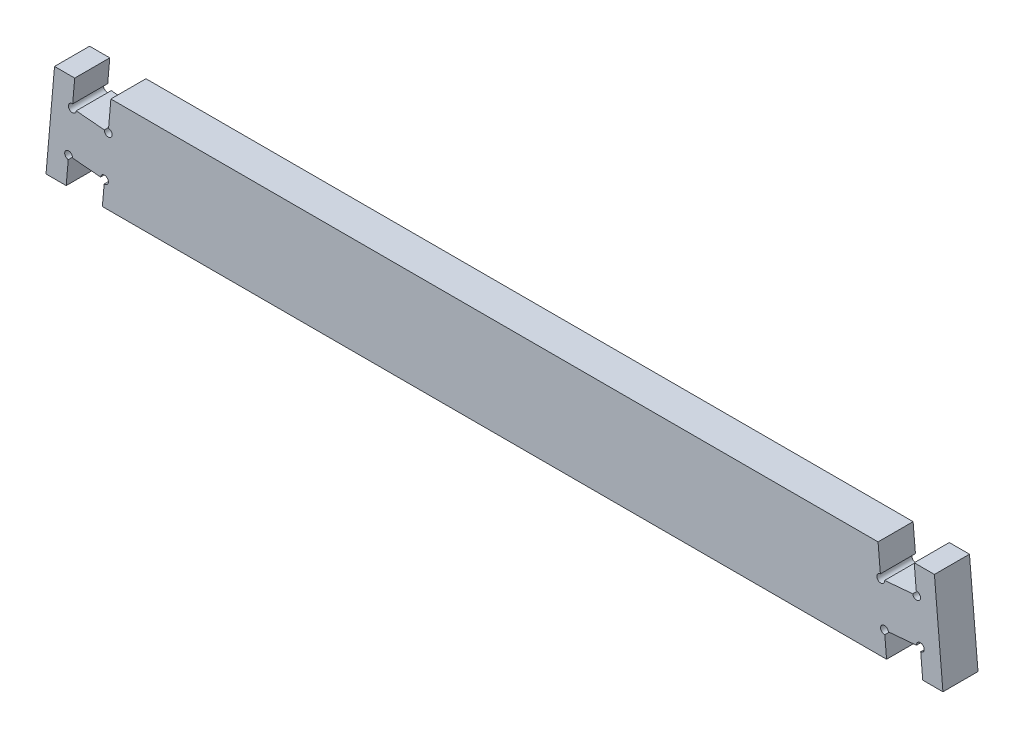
from build123d import *

# Parameters (mm, degrees)
BOSS_EXTRUDE1_DEPTH = 18
CUT_EXTRUDE1_REACH  = 413.236
SKETCH2_R           = 2


with BuildPart() as part:
    # Sketch1 → Boss-Extrude1 (new body)
    with BuildSketch(Plane.XY):
        Polygon((199.401555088, -312.400652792), (180.971953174, -314.013034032), (182.06305364, -326.484369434), (-220.466570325, -326.484369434), (-219.375469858, -314.013034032), (-237.805071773, -312.400652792), (-239.037237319, -326.484369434), (-249.397098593, -326.484369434), (-245.022665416, -276.484369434), (-234.662804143, -276.484369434), (-235.887645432, -290.484369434), (-217.458043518, -292.096750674), (-216.092137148, -276.484369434), (177.688620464, -276.484369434), (179.054526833, -292.096750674), (197.484128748, -290.484369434), (196.259287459, -276.484369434), (206.619148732, -276.484369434), (210.993581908, -326.484369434), (200.633720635, -326.484369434), align=None)
    extrude(amount=BOSS_EXTRUDE1_DEPTH)

    # Sketch2 → Cut-Extrude1 (cut, up to next)
    with BuildSketch(Plane.XY.offset(18), mode=Mode.PRIVATE) as cut_extrude1_sk1:
        with Locations((197.484128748, -290.484369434)):
            Circle(SKETCH2_R)
    cut_extrude1_tool1 = extrude(cut_extrude1_sk1.sketch, amount=-CUT_EXTRUDE1_REACH, mode=Mode.PRIVATE) & part.part
    # Sketch2 → Cut-Extrude1 (cut, up to next)
    with BuildSketch(Plane.XY.offset(18), mode=Mode.PRIVATE) as cut_extrude1_sk2:
        with Locations((179.054526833, -292.096750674)):
            Circle(SKETCH2_R)
    cut_extrude1_tool2 = extrude(cut_extrude1_sk2.sketch, amount=-CUT_EXTRUDE1_REACH, mode=Mode.PRIVATE) & part.part
    # Sketch2 → Cut-Extrude1 (cut, up to next)
    with BuildSketch(Plane.XY.offset(18), mode=Mode.PRIVATE) as cut_extrude1_sk3:
        with Locations((199.401555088, -312.400652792)):
            Circle(SKETCH2_R)
    cut_extrude1_tool3 = extrude(cut_extrude1_sk3.sketch, amount=-CUT_EXTRUDE1_REACH, mode=Mode.PRIVATE) & part.part
    # Sketch2 → Cut-Extrude1 (cut, up to next)
    with BuildSketch(Plane.XY.offset(18), mode=Mode.PRIVATE) as cut_extrude1_sk4:
        with Locations((180.971953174, -314.013034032)):
            Circle(SKETCH2_R)
    cut_extrude1_tool4 = extrude(cut_extrude1_sk4.sketch, amount=-CUT_EXTRUDE1_REACH, mode=Mode.PRIVATE) & part.part
    # Sketch2 → Cut-Extrude1 (cut, up to next)
    with BuildSketch(Plane.XY.offset(18), mode=Mode.PRIVATE) as cut_extrude1_sk5:
        with Locations((-217.458043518, -292.096750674)):
            Circle(SKETCH2_R)
    cut_extrude1_tool5 = extrude(cut_extrude1_sk5.sketch, amount=-CUT_EXTRUDE1_REACH, mode=Mode.PRIVATE) & part.part
    # Sketch2 → Cut-Extrude1 (cut, up to next)
    with BuildSketch(Plane.XY.offset(18), mode=Mode.PRIVATE) as cut_extrude1_sk6:
        with Locations((-219.375469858, -314.013034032)):
            Circle(SKETCH2_R)
    cut_extrude1_tool6 = extrude(cut_extrude1_sk6.sketch, amount=-CUT_EXTRUDE1_REACH, mode=Mode.PRIVATE) & part.part
    # Sketch2 → Cut-Extrude1 (cut, up to next)
    with BuildSketch(Plane.XY.offset(18), mode=Mode.PRIVATE) as cut_extrude1_sk7:
        with Locations((-235.887645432, -290.484369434)):
            Circle(SKETCH2_R)
    cut_extrude1_tool7 = extrude(cut_extrude1_sk7.sketch, amount=-CUT_EXTRUDE1_REACH, mode=Mode.PRIVATE) & part.part
    # Sketch2 → Cut-Extrude1 (cut, up to next)
    with BuildSketch(Plane.XY.offset(18), mode=Mode.PRIVATE) as cut_extrude1_sk8:
        with Locations((-237.805071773, -312.400652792)):
            Circle(SKETCH2_R)
    cut_extrude1_tool8 = extrude(cut_extrude1_sk8.sketch, amount=-CUT_EXTRUDE1_REACH, mode=Mode.PRIVATE) & part.part
    add(cut_extrude1_tool1.solids().sort_by_distance((197.484129, -290.484369, 18))[0], mode=Mode.SUBTRACT)
    add(cut_extrude1_tool2.solids().sort_by_distance((179.054527, -292.096751, 18))[0], mode=Mode.SUBTRACT)
    add(cut_extrude1_tool3.solids().sort_by_distance((199.401555, -312.400653, 18))[0], mode=Mode.SUBTRACT)
    add(cut_extrude1_tool4.solids().sort_by_distance((180.971953, -314.013034, 18))[0], mode=Mode.SUBTRACT)
    add(cut_extrude1_tool5.solids().sort_by_distance((-217.458044, -292.096751, 18))[0], mode=Mode.SUBTRACT)
    add(cut_extrude1_tool6.solids().sort_by_distance((-219.37547, -314.013034, 18))[0], mode=Mode.SUBTRACT)
    add(cut_extrude1_tool7.solids().sort_by_distance((-235.887645, -290.484369, 18))[0], mode=Mode.SUBTRACT)
    add(cut_extrude1_tool8.solids().sort_by_distance((-237.805072, -312.400653, 18))[0], mode=Mode.SUBTRACT)


solid = part.part
